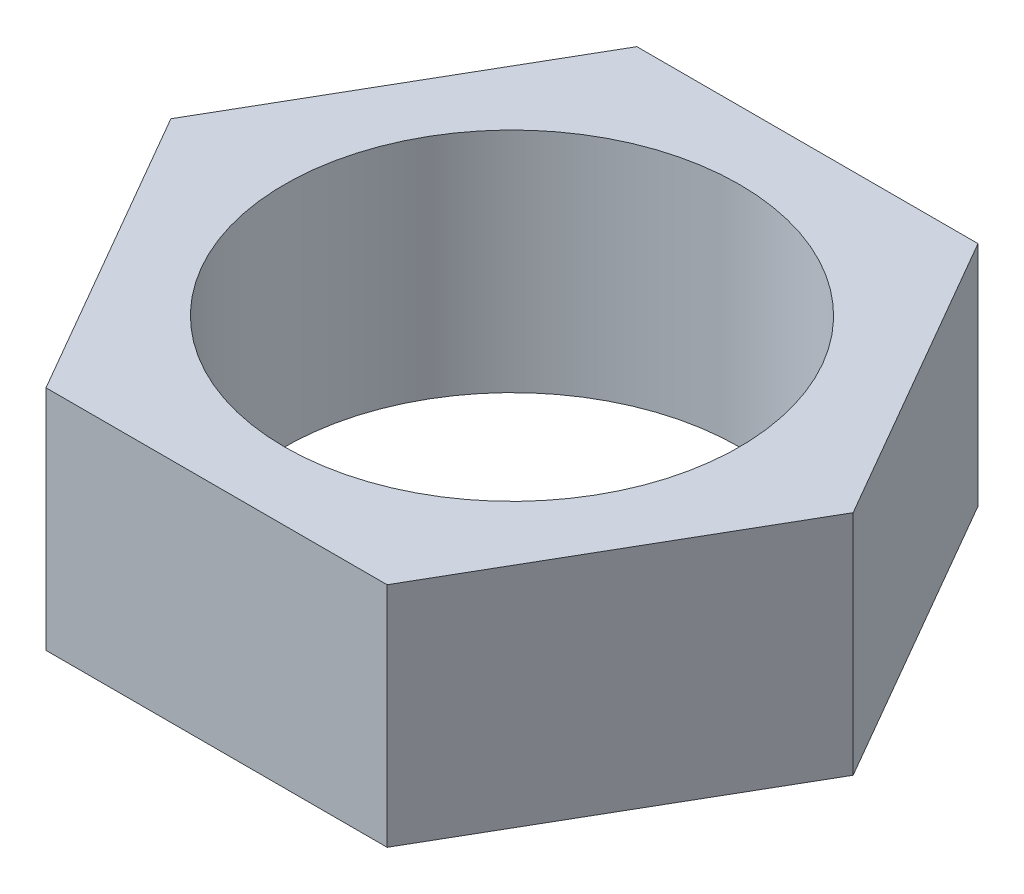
from build123d import *

# Parameters (mm, degrees)
SKETCH1_R           = 2
BOSS_EXTRUDE1_DEPTH = 2


with BuildPart() as part:
    # Sketch1 → Boss-Extrude1 (new body)
    with BuildSketch(Plane(origin=(0, 0, 0), x_dir=(1, 0, 0), z_dir=(0, 1, 0))):
        Polygon((-3, 0), (-1.5, -2.598076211), (1.5, -2.598076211), (3, 0), (1.5, 2.598076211), (-1.5, 2.598076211), align=None)
        with Locations(Location((0, 0, 0), (0, 0, 270))):
            Circle(SKETCH1_R, mode=Mode.SUBTRACT)
    extrude(amount=BOSS_EXTRUDE1_DEPTH)


solid = part.part
